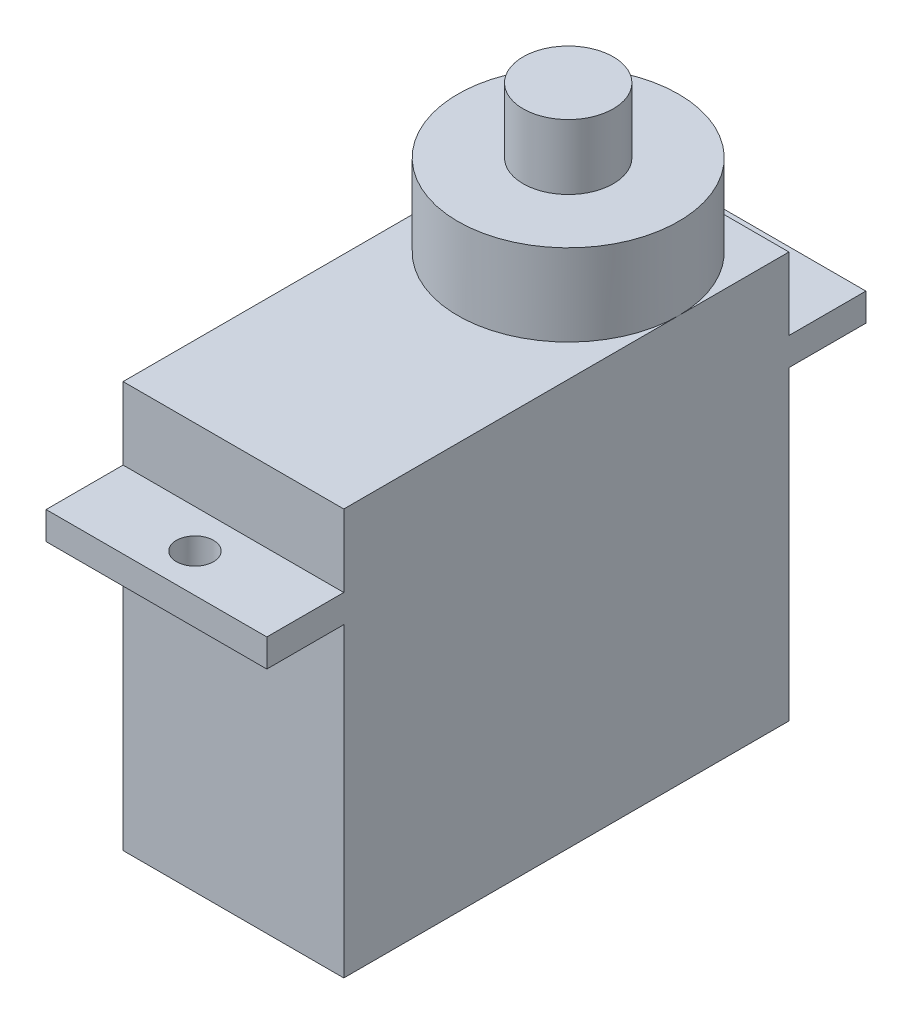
from build123d import *

# Parameters (mm, degrees)
SKETCH1_W           = 11.9
SKETCH1_H           = 24
BOSS_EXTRUDE1_DEPTH = 16.5
SKETCH2_W           = 11.9
SKETCH2_H           = 32.3
BOSS_EXTRUDE2_DEPTH = 1.5
SKETCH3_W           = 11.9
SKETCH3_H           = 24
BOSS_EXTRUDE3_DEPTH = 3.9
SKETCH4_R           = 5.95
BOSS_EXTRUDE4_DEPTH = 4.4
SKETCH5_R           = 2.43
BOSS_EXTRUDE5_DEPTH = 3.5
SKETCH6_R           = 1
CUT_EXTRUDE1_DEPTH  = 25.904316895
SKETCH7_W           = 4
SKETCH7_H           = 3
CUT_EXTRUDE2_DEPTH  = 3.5


with BuildPart() as part:
    # Sketch1 → Boss-Extrude1 (new body)
    with BuildSketch(Plane(origin=(0, 0, 0), x_dir=(1, 0, 0), z_dir=(0, 1, 0))):
        Rectangle(SKETCH1_W, SKETCH1_H)
    extrude(amount=BOSS_EXTRUDE1_DEPTH)

    # Sketch2 → Boss-Extrude2 (add)
    with BuildSketch(Plane(origin=(0, 16.5, 0), x_dir=(1, 0, 0), z_dir=(0, 1, 0))):
        Rectangle(SKETCH2_W, SKETCH2_H)
    extrude(amount=BOSS_EXTRUDE2_DEPTH)

    # Sketch3 → Boss-Extrude3 (add)
    with BuildSketch(Plane(origin=(0, 18, 0), x_dir=(1, 0, 0), z_dir=(0, 1, 0))):
        Rectangle(SKETCH3_W, SKETCH3_H)
    extrude(amount=BOSS_EXTRUDE3_DEPTH)

    # Sketch4 → Boss-Extrude4 (add)
    with BuildSketch(Plane(origin=(0, 21.9, 0), x_dir=(1, 0, 0), z_dir=(0, 1, 0))):
        with Locations(Location((0, 6.05, 0), (0, 0, 90))):
            Circle(SKETCH4_R)
    extrude(amount=BOSS_EXTRUDE4_DEPTH)

    # Sketch5 → Boss-Extrude5 (add)
    with BuildSketch(Plane(origin=(0, 26.3, 0), x_dir=(1, 0, 0), z_dir=(0, 1, 0))):
        with Locations(Location((0, 6.05, 0), (0, 0, 270))):
            Circle(SKETCH5_R)
    extrude(amount=BOSS_EXTRUDE5_DEPTH)

    # Sketch6 → Cut-Extrude1 (cut, through all)
    with BuildSketch(Plane(origin=(0, 18, 0), x_dir=(1, 0, 0), z_dir=(0, 1, 0))):
        with Locations(Location((0, -14.075, 0), (0, 0, 270))):
            Circle(SKETCH6_R)
        with Locations(Location((0, 14.075, 0), (0, 0, 270))):
            Circle(SKETCH6_R)
    extrude(amount=-CUT_EXTRUDE1_DEPTH, mode=Mode.SUBTRACT)

    # Sketch7 → Cut-Extrude2 (cut)
    with BuildSketch(Plane(origin=(0, 0, -12), x_dir=(-1, 0, 0), z_dir=(0, 0, -1))):
        with Locations((0, 1.5)):
            Rectangle(SKETCH7_W, SKETCH7_H)
    extrude(amount=-CUT_EXTRUDE2_DEPTH, mode=Mode.SUBTRACT)


solid = part.part
